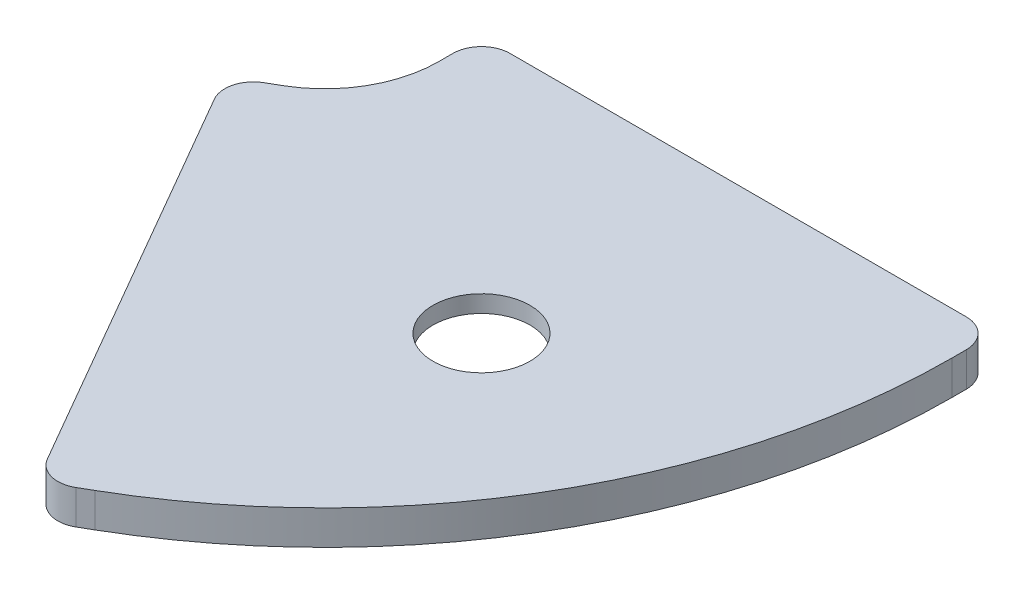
ISO-10303-21;
HEADER;
FILE_DESCRIPTION(('STEP AP214'),'2;1');
FILE_NAME('part.step','',(''),(''),'','','');
FILE_SCHEMA(('AUTOMOTIVE_DESIGN { 1 0 10303 214 1 1 1 1 }'));
ENDSEC;
DATA;
#1=APPLICATION_CONTEXT('core data for automotive mechanical design processes');
#2=APPLICATION_PROTOCOL_DEFINITION('international standard','automotive_design',2000,#1);
#3=PRODUCT_CONTEXT('',#1,'mechanical');
#4=PRODUCT('Part','Part','',(#3));
#5=PRODUCT_RELATED_PRODUCT_CATEGORY('part','',(#4));
#6=PRODUCT_DEFINITION_FORMATION('','',#4);
#7=PRODUCT_DEFINITION_CONTEXT('part definition',#1,'design');
#8=PRODUCT_DEFINITION('design','',#6,#7);
#9=PRODUCT_DEFINITION_SHAPE('','',#8);
#10=(LENGTH_UNIT() NAMED_UNIT(*) SI_UNIT(.MILLI.,.METRE.));
#11=(NAMED_UNIT(*) PLANE_ANGLE_UNIT() SI_UNIT($,.RADIAN.));
#12=(NAMED_UNIT(*) SI_UNIT($,.STERADIAN.) SOLID_ANGLE_UNIT());
#13=UNCERTAINTY_MEASURE_WITH_UNIT(LENGTH_MEASURE(1.E-05),#10,'distance_accuracy_value','');
#14=(GEOMETRIC_REPRESENTATION_CONTEXT(3) GLOBAL_UNCERTAINTY_ASSIGNED_CONTEXT((#13)) GLOBAL_UNIT_ASSIGNED_CONTEXT((#10,
#11,#12)) REPRESENTATION_CONTEXT('',''));
#15=CARTESIAN_POINT('',(0.,0.,0.));
#16=DIRECTION('',(0.,0.,1.));
#17=DIRECTION('',(1.,0.,0.));
#18=AXIS2_PLACEMENT_3D('',#15,#16,#17);
#19=CARTESIAN_POINT('',(22.5,-2.25,22.5));
#20=DIRECTION('',(0.,-1.,0.));
#21=DIRECTION('',(0.,0.,-1.));
#22=AXIS2_PLACEMENT_3D('',#19,#20,#21);
#23=CYLINDRICAL_SURFACE('',#22,6.5);
#24=CARTESIAN_POINT('',(22.5,-1.5,22.5));
#25=DIRECTION('',(0.,1.,0.));
#26=DIRECTION('',(1.,0.,0.));
#27=AXIS2_PLACEMENT_3D('',#24,#25,#26);
#28=CIRCLE('',#27,6.5);
#29=CARTESIAN_POINT('',(29.,-1.5,22.5));
#30=VERTEX_POINT('',#29);
#31=EDGE_CURVE('E9',#30,#30,#28,.T.);
#32=ORIENTED_EDGE('',*,*,#31,.T.);
#33=EDGE_LOOP('',(#32));
#34=FACE_BOUND('',#33,.T.);
#35=CARTESIAN_POINT('',(22.5,-3.,22.5));
#36=DIRECTION('',(0.,1.,0.));
#37=DIRECTION('',(1.,0.,0.));
#38=AXIS2_PLACEMENT_3D('',#35,#36,#37);
#39=CIRCLE('',#38,6.5);
#40=CARTESIAN_POINT('',(29.,-3.,22.5));
#41=VERTEX_POINT('',#40);
#42=EDGE_CURVE('E187',#41,#41,#39,.T.);
#43=ORIENTED_EDGE('',*,*,#42,.F.);
#44=EDGE_LOOP('',(#43));
#45=FACE_BOUND('',#44,.T.);
#46=ADVANCED_FACE('F15',(#34,#45),#23,.F.);
#47=CARTESIAN_POINT('',(22.5,-1.5,22.5));
#48=DIRECTION('',(0.,1.,0.));
#49=DIRECTION('',(0.,0.,1.));
#50=AXIS2_PLACEMENT_3D('',#47,#48,#49);
#51=PLANE('',#50);
#52=CARTESIAN_POINT('',(22.5,-1.5,22.5));
#53=DIRECTION('',(0.,-1.,0.));
#54=DIRECTION('',(0.,0.,-1.));
#55=AXIS2_PLACEMENT_3D('',#52,#53,#54);
#56=CIRCLE('',#55,4.25);
#57=CARTESIAN_POINT('',(22.5,-1.5,18.25));
#58=VERTEX_POINT('',#57);
#59=EDGE_CURVE('E25',#58,#58,#56,.T.);
#60=ORIENTED_EDGE('',*,*,#59,.F.);
#61=EDGE_LOOP('',(#60));
#62=FACE_BOUND('',#61,.T.);
#63=ORIENTED_EDGE('',*,*,#31,.F.);
#64=EDGE_LOOP('',(#63));
#65=FACE_BOUND('',#64,.T.);
#66=ADVANCED_FACE('F214',(#62,#65),#51,.F.);
#67=CARTESIAN_POINT('',(22.5,-1.5,22.5));
#68=DIRECTION('',(0.,-1.,0.));
#69=DIRECTION('',(0.,0.,-1.));
#70=AXIS2_PLACEMENT_3D('',#67,#68,#69);
#71=CYLINDRICAL_SURFACE('',#70,4.25);
#72=ORIENTED_EDGE('',*,*,#59,.T.);
#73=EDGE_LOOP('',(#72));
#74=FACE_BOUND('',#73,.T.);
#75=CARTESIAN_POINT('',(22.5,0.,22.5));
#76=DIRECTION('',(0.,-1.,0.));
#77=DIRECTION('',(0.,0.,-1.));
#78=AXIS2_PLACEMENT_3D('',#75,#76,#77);
#79=CIRCLE('',#78,4.25);
#80=CARTESIAN_POINT('',(22.5,0.,18.25));
#81=VERTEX_POINT('',#80);
#82=EDGE_CURVE('E111',#81,#81,#79,.T.);
#83=ORIENTED_EDGE('',*,*,#82,.F.);
#84=EDGE_LOOP('',(#83));
#85=FACE_BOUND('',#84,.T.);
#86=ADVANCED_FACE('F221',(#74,#85),#71,.F.);
#87=CARTESIAN_POINT('',(2.49999924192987,0.,2.49999972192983));
#88=DIRECTION('',(0.,-1.,0.));
#89=DIRECTION('',(0.,0.,-1.));
#90=AXIS2_PLACEMENT_3D('',#87,#88,#89);
#91=CYLINDRICAL_SURFACE('',#90,2.49999924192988);
#92=CARTESIAN_POINT('',(2.49999924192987,-3.,2.49999972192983));
#93=DIRECTION('',(0.,1.,0.));
#94=DIRECTION('',(1.,0.,0.));
#95=AXIS2_PLACEMENT_3D('',#92,#93,#94);
#96=CIRCLE('',#95,2.49999924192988);
#97=CARTESIAN_POINT('',(2.49999975,-3.,4.4E-07));
#98=VERTEX_POINT('',#97);
#99=CARTESIAN_POINT('',(0.,-3.,2.50000004));
#100=VERTEX_POINT('',#99);
#101=EDGE_CURVE('E200',#98,#100,#96,.T.);
#102=ORIENTED_EDGE('',*,*,#101,.T.);
#103=DIRECTION('',(0.,-1.,0.));
#104=VECTOR('',#103,1.);
#105=CARTESIAN_POINT('',(0.,0.,2.50000004));
#106=LINE('',#105,#104);
#107=CARTESIAN_POINT('',(0.,0.,2.50000004));
#108=VERTEX_POINT('',#107);
#109=EDGE_CURVE('E34',#108,#100,#106,.T.);
#110=ORIENTED_EDGE('',*,*,#109,.F.);
#111=CARTESIAN_POINT('',(2.49999924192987,0.,2.49999972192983));
#112=DIRECTION('',(0.,-1.,0.));
#113=DIRECTION('',(0.,0.,-1.));
#114=AXIS2_PLACEMENT_3D('',#111,#112,#113);
#115=CIRCLE('',#114,2.49999924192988);
#116=CARTESIAN_POINT('',(2.49999975,0.,4.4E-07));
#117=VERTEX_POINT('',#116);
#118=EDGE_CURVE('E198',#108,#117,#115,.T.);
#119=ORIENTED_EDGE('',*,*,#118,.T.);
#120=DIRECTION('',(0.,-1.,0.));
#121=VECTOR('',#120,1.);
#122=CARTESIAN_POINT('',(2.49999975,0.,4.4E-07));
#123=LINE('',#122,#121);
#124=EDGE_CURVE('E125',#117,#98,#123,.T.);
#125=ORIENTED_EDGE('',*,*,#124,.T.);
#126=EDGE_LOOP('',(#102,#110,#119,#125));
#127=FACE_BOUND('',#126,.T.);
#128=ADVANCED_FACE('F229',(#127),#91,.T.);
#129=CARTESIAN_POINT('',(0.,0.,2.50000004));
#130=DIRECTION('',(-0.999999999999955,0.,2.99324566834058E-07));
#131=DIRECTION('',(2.99324566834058E-07,0.,0.999999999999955));
#132=AXIS2_PLACEMENT_3D('',#129,#130,#131);
#133=PLANE('',#132);
#134=DIRECTION('',(2.99324566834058E-07,0.,0.999999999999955));
#135=VECTOR('',#134,1.);
#136=CARTESIAN_POINT('',(3.700000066E-07,-3.,3.73611642));
#137=LINE('',#136,#135);
#138=CARTESIAN_POINT('',(3.70000002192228E-07,-3.,3.73611642));
#139=VERTEX_POINT('',#138);
#140=EDGE_CURVE('E194',#100,#139,#137,.T.);
#141=ORIENTED_EDGE('',*,*,#140,.T.);
#142=DIRECTION('',(0.,-1.,0.));
#143=VECTOR('',#142,1.);
#144=CARTESIAN_POINT('',(3.70000002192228E-07,0.,3.73611642));
#145=LINE('',#144,#143);
#146=CARTESIAN_POINT('',(3.70000002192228E-07,0.,3.73611642));
#147=VERTEX_POINT('',#146);
#148=EDGE_CURVE('E184',#147,#139,#145,.T.);
#149=ORIENTED_EDGE('',*,*,#148,.F.);
#150=DIRECTION('',(-2.99324566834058E-07,0.,-0.999999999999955));
#151=VECTOR('',#150,1.);
#152=CARTESIAN_POINT('',(3.700000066E-07,0.,3.73611642));
#153=LINE('',#152,#151);
#154=EDGE_CURVE('E192',#147,#108,#153,.T.);
#155=ORIENTED_EDGE('',*,*,#154,.T.);
#156=ORIENTED_EDGE('',*,*,#109,.T.);
#157=EDGE_LOOP('',(#141,#149,#155,#156));
#158=FACE_BOUND('',#157,.T.);
#159=ADVANCED_FACE('F233',(#158),#133,.T.);
#160=CARTESIAN_POINT('',(-10.0000027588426,0.,3.73611365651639));
#161=DIRECTION('',(0.,-1.,0.));
#162=DIRECTION('',(0.,0.,-1.));
#163=AXIS2_PLACEMENT_3D('',#160,#161,#162);
#164=CYLINDRICAL_SURFACE('',#163,10.000003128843);
#165=CARTESIAN_POINT('',(-10.0000027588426,-3.,3.73611365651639));
#166=DIRECTION('',(0.,-1.,0.));
#167=DIRECTION('',(0.,0.,-1.));
#168=AXIS2_PLACEMENT_3D('',#165,#166,#167);
#169=CIRCLE('',#168,10.000003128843);
#170=CARTESIAN_POINT('',(-5.00000045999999,-3.,12.39636998));
#171=VERTEX_POINT('',#170);
#172=EDGE_CURVE('E189',#139,#171,#169,.T.);
#173=ORIENTED_EDGE('',*,*,#172,.T.);
#174=DIRECTION('',(0.,-1.,0.));
#175=VECTOR('',#174,1.);
#176=CARTESIAN_POINT('',(-5.00000045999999,0.,12.39636998));
#177=LINE('',#176,#175);
#178=CARTESIAN_POINT('',(-5.00000045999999,0.,12.39636998));
#179=VERTEX_POINT('',#178);
#180=EDGE_CURVE('E176',#179,#171,#177,.T.);
#181=ORIENTED_EDGE('',*,*,#180,.F.);
#182=CARTESIAN_POINT('',(-10.0000027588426,0.,3.73611365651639));
#183=DIRECTION('',(0.,-1.,0.));
#184=DIRECTION('',(0.,0.,-1.));
#185=AXIS2_PLACEMENT_3D('',#182,#183,#184);
#186=CIRCLE('',#185,10.000003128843);
#187=EDGE_CURVE('E185',#147,#179,#186,.T.);
#188=ORIENTED_EDGE('',*,*,#187,.F.);
#189=ORIENTED_EDGE('',*,*,#148,.T.);
#190=EDGE_LOOP('',(#173,#181,#188,#189));
#191=FACE_BOUND('',#190,.T.);
#192=ADVANCED_FACE('F235',(#191),#164,.F.);
#193=CARTESIAN_POINT('',(-5.00000045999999,0.,12.39636998));
#194=DIRECTION('',(-0.50000002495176,0.,-0.866025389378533));
#195=DIRECTION('',(-0.866025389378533,0.,0.50000002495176));
#196=AXIS2_PLACEMENT_3D('',#193,#194,#195);
#197=PLANE('',#196);
#198=DIRECTION('',(-0.866025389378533,0.,0.500000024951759));
#199=VECTOR('',#198,1.);
#200=CARTESIAN_POINT('',(-6.07050842,-3.,13.01442808));
#201=LINE('',#200,#199);
#202=CARTESIAN_POINT('',(-6.07050842,-3.,13.01442808));
#203=VERTEX_POINT('',#202);
#204=EDGE_CURVE('E180',#171,#203,#201,.T.);
#205=ORIENTED_EDGE('',*,*,#204,.T.);
#206=DIRECTION('',(0.,-1.,0.));
#207=VECTOR('',#206,1.);
#208=CARTESIAN_POINT('',(-6.07050842,0.,13.01442808));
#209=LINE('',#208,#207);
#210=CARTESIAN_POINT('',(-6.07050842,0.,13.01442808));
#211=VERTEX_POINT('',#210);
#212=EDGE_CURVE('E168',#211,#203,#209,.T.);
#213=ORIENTED_EDGE('',*,*,#212,.F.);
#214=DIRECTION('',(0.866025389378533,0.,-0.500000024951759));
#215=VECTOR('',#214,1.);
#216=CARTESIAN_POINT('',(-6.07050842,0.,13.01442808));
#217=LINE('',#216,#215);
#218=EDGE_CURVE('E177',#211,#179,#217,.T.);
#219=ORIENTED_EDGE('',*,*,#218,.T.);
#220=ORIENTED_EDGE('',*,*,#180,.T.);
#221=EDGE_LOOP('',(#205,#213,#219,#220));
#222=FACE_BOUND('',#221,.T.);
#223=ADVANCED_FACE('F238',(#222),#197,.T.);
#224=CARTESIAN_POINT('',(-4.8205072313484,0.,15.1794917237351));
#225=DIRECTION('',(0.,-1.,0.));
#226=DIRECTION('',(0.,0.,-1.));
#227=AXIS2_PLACEMENT_3D('',#224,#225,#226);
#228=CYLINDRICAL_SURFACE('',#227,2.50000071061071);
#229=CARTESIAN_POINT('',(-4.8205072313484,-3.,15.1794917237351));
#230=DIRECTION('',(0.,1.,0.));
#231=DIRECTION('',(1.,0.,0.));
#232=AXIS2_PLACEMENT_3D('',#229,#230,#231);
#233=CIRCLE('',#232,2.50000071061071);
#234=CARTESIAN_POINT('',(-6.9855715,-3.,16.42949183));
#235=VERTEX_POINT('',#234);
#236=EDGE_CURVE('E172',#203,#235,#233,.T.);
#237=ORIENTED_EDGE('',*,*,#236,.T.);
#238=DIRECTION('',(0.,-1.,0.));
#239=VECTOR('',#238,1.);
#240=CARTESIAN_POINT('',(-6.9855715,0.,16.42949183));
#241=LINE('',#240,#239);
#242=CARTESIAN_POINT('',(-6.9855715,0.,16.42949183));
#243=VERTEX_POINT('',#242);
#244=EDGE_CURVE('E160',#243,#235,#241,.T.);
#245=ORIENTED_EDGE('',*,*,#244,.F.);
#246=CARTESIAN_POINT('',(-4.8205072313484,0.,15.1794917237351));
#247=DIRECTION('',(0.,-1.,0.));
#248=DIRECTION('',(0.,0.,-1.));
#249=AXIS2_PLACEMENT_3D('',#246,#247,#248);
#250=CIRCLE('',#249,2.50000071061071);
#251=EDGE_CURVE('E169',#243,#211,#250,.T.);
#252=ORIENTED_EDGE('',*,*,#251,.T.);
#253=ORIENTED_EDGE('',*,*,#212,.T.);
#254=EDGE_LOOP('',(#237,#245,#252,#253));
#255=FACE_BOUND('',#254,.T.);
#256=ADVANCED_FACE('F240',(#255),#228,.T.);
#257=CARTESIAN_POINT('',(-6.9855715,0.,16.42949183));
#258=DIRECTION('',(-0.86602541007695,0.,0.499999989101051));
#259=DIRECTION('',(0.499999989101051,0.,0.86602541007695));
#260=AXIS2_PLACEMENT_3D('',#257,#258,#259);
#261=PLANE('',#260);
#262=DIRECTION('',(0.499999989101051,0.,0.86602541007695));
#263=VECTOR('',#262,1.);
#264=CARTESIAN_POINT('',(13.01442812,-3.,51.07050833));
#265=LINE('',#264,#263);
#266=CARTESIAN_POINT('',(13.01442812,-3.,51.07050833));
#267=VERTEX_POINT('',#266);
#268=EDGE_CURVE('E164',#235,#267,#265,.T.);
#269=ORIENTED_EDGE('',*,*,#268,.T.);
#270=DIRECTION('',(0.,-1.,0.));
#271=VECTOR('',#270,1.);
#272=CARTESIAN_POINT('',(13.01442812,0.,51.07050833));
#273=LINE('',#272,#271);
#274=CARTESIAN_POINT('',(13.01442812,0.,51.07050833));
#275=VERTEX_POINT('',#274);
#276=EDGE_CURVE('E152',#275,#267,#273,.T.);
#277=ORIENTED_EDGE('',*,*,#276,.F.);
#278=DIRECTION('',(-0.499999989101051,0.,-0.86602541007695));
#279=VECTOR('',#278,1.);
#280=CARTESIAN_POINT('',(13.01442812,0.,51.07050833));
#281=LINE('',#280,#279);
#282=EDGE_CURVE('E161',#275,#243,#281,.T.);
#283=ORIENTED_EDGE('',*,*,#282,.T.);
#284=ORIENTED_EDGE('',*,*,#244,.T.);
#285=EDGE_LOOP('',(#269,#277,#283,#284));
#286=FACE_BOUND('',#285,.T.);
#287=ADVANCED_FACE('F243',(#286),#261,.T.);
#288=CARTESIAN_POINT('',(15.1794917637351,0.,49.8205071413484));
#289=DIRECTION('',(0.,-1.,0.));
#290=DIRECTION('',(0.,0.,-1.));
#291=AXIS2_PLACEMENT_3D('',#288,#289,#290);
#292=CYLINDRICAL_SURFACE('',#291,2.5000007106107);
#293=CARTESIAN_POINT('',(15.1794917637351,-3.,49.8205071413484));
#294=DIRECTION('',(0.,1.,0.));
#295=DIRECTION('',(1.,0.,0.));
#296=AXIS2_PLACEMENT_3D('',#293,#294,#295);
#297=CIRCLE('',#296,2.5000007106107);
#298=CARTESIAN_POINT('',(16.42949187,-3.,51.98557141));
#299=VERTEX_POINT('',#298);
#300=EDGE_CURVE('E156',#267,#299,#297,.T.);
#301=ORIENTED_EDGE('',*,*,#300,.T.);
#302=DIRECTION('',(0.,-1.,0.));
#303=VECTOR('',#302,1.);
#304=CARTESIAN_POINT('',(16.42949187,0.,51.98557141));
#305=LINE('',#304,#303);
#306=CARTESIAN_POINT('',(16.42949187,0.,51.98557141));
#307=VERTEX_POINT('',#306);
#308=EDGE_CURVE('E144',#307,#299,#305,.T.);
#309=ORIENTED_EDGE('',*,*,#308,.F.);
#310=CARTESIAN_POINT('',(15.1794917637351,0.,49.8205071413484));
#311=DIRECTION('',(0.,-1.,0.));
#312=DIRECTION('',(0.,0.,-1.));
#313=AXIS2_PLACEMENT_3D('',#310,#311,#312);
#314=CIRCLE('',#313,2.5000007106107);
#315=EDGE_CURVE('E153',#307,#275,#314,.T.);
#316=ORIENTED_EDGE('',*,*,#315,.T.);
#317=ORIENTED_EDGE('',*,*,#276,.T.);
#318=EDGE_LOOP('',(#301,#309,#316,#317));
#319=FACE_BOUND('',#318,.T.);
#320=ADVANCED_FACE('F245',(#319),#292,.T.);
#321=CARTESIAN_POINT('',(16.42949187,0.,51.98557141));
#322=DIRECTION('',(0.499999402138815,0.,0.86602574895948));
#323=DIRECTION('',(0.86602574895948,0.,-0.499999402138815));
#324=AXIS2_PLACEMENT_3D('',#321,#322,#323);
#325=PLANE('',#324);
#326=DIRECTION('',(0.866025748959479,0.,-0.499999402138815));
#327=VECTOR('',#326,1.);
#328=CARTESIAN_POINT('',(17.49999972,-3.,51.3675144));
#329=LINE('',#328,#327);
#330=CARTESIAN_POINT('',(17.49999972,-3.,51.3675144));
#331=VERTEX_POINT('',#330);
#332=EDGE_CURVE('E148',#299,#331,#329,.T.);
#333=ORIENTED_EDGE('',*,*,#332,.T.);
#334=DIRECTION('',(0.,-1.,0.));
#335=VECTOR('',#334,1.);
#336=CARTESIAN_POINT('',(17.49999972,0.,51.3675144));
#337=LINE('',#336,#335);
#338=CARTESIAN_POINT('',(17.49999972,0.,51.3675144));
#339=VERTEX_POINT('',#338);
#340=EDGE_CURVE('E136',#339,#331,#337,.T.);
#341=ORIENTED_EDGE('',*,*,#340,.F.);
#342=DIRECTION('',(-0.866025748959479,0.,0.499999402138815));
#343=VECTOR('',#342,1.);
#344=CARTESIAN_POINT('',(17.49999972,0.,51.3675144));
#345=LINE('',#344,#343);
#346=EDGE_CURVE('E145',#339,#307,#345,.T.);
#347=ORIENTED_EDGE('',*,*,#346,.T.);
#348=ORIENTED_EDGE('',*,*,#308,.T.);
#349=EDGE_LOOP('',(#333,#341,#347,#348));
#350=FACE_BOUND('',#349,.T.);
#351=ADVANCED_FACE('F247',(#350),#325,.T.);
#352=CARTESIAN_POINT('',(-10.0000048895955,0.,3.73611474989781));
#353=DIRECTION('',(0.,-1.,0.));
#354=DIRECTION('',(0.,0.,-1.));
#355=AXIS2_PLACEMENT_3D('',#352,#353,#354);
#356=CYLINDRICAL_SURFACE('',#355,55.0000044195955);
#357=CARTESIAN_POINT('',(-10.0000048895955,-3.,3.73611474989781));
#358=DIRECTION('',(0.,1.,0.));
#359=DIRECTION('',(1.,0.,0.));
#360=AXIS2_PLACEMENT_3D('',#357,#358,#359);
#361=CIRCLE('',#360,55.0000044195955);
#362=CARTESIAN_POINT('',(44.99999953,-3.,3.7361159));
#363=VERTEX_POINT('',#362);
#364=EDGE_CURVE('E140',#331,#363,#361,.T.);
#365=ORIENTED_EDGE('',*,*,#364,.T.);
#366=DIRECTION('',(0.,-1.,0.));
#367=VECTOR('',#366,1.);
#368=CARTESIAN_POINT('',(44.99999953,0.,3.7361159));
#369=LINE('',#368,#367);
#370=CARTESIAN_POINT('',(44.99999953,0.,3.7361159));
#371=VERTEX_POINT('',#370);
#372=EDGE_CURVE('E131',#371,#363,#369,.T.);
#373=ORIENTED_EDGE('',*,*,#372,.F.);
#374=CARTESIAN_POINT('',(-10.0000048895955,0.,3.73611474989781));
#375=DIRECTION('',(0.,-1.,0.));
#376=DIRECTION('',(0.,0.,-1.));
#377=AXIS2_PLACEMENT_3D('',#374,#375,#376);
#378=CIRCLE('',#377,55.0000044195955);
#379=EDGE_CURVE('E137',#371,#339,#378,.T.);
#380=ORIENTED_EDGE('',*,*,#379,.T.);
#381=ORIENTED_EDGE('',*,*,#340,.T.);
#382=EDGE_LOOP('',(#365,#373,#380,#381));
#383=FACE_BOUND('',#382,.T.);
#384=ADVANCED_FACE('F249',(#383),#356,.T.);
#385=CARTESIAN_POINT('',(44.99999953,0.,3.7361159));
#386=DIRECTION('',(0.999999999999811,0.,6.14829162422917E-07));
#387=DIRECTION('',(6.14829162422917E-07,0.,-0.999999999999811));
#388=AXIS2_PLACEMENT_3D('',#385,#386,#387);
#389=PLANE('',#388);
#390=DIRECTION('',(6.14829162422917E-07,0.,-0.999999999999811));
#391=VECTOR('',#390,1.);
#392=CARTESIAN_POINT('',(45.00000029,-3.,2.50000017));
#393=LINE('',#392,#391);
#394=CARTESIAN_POINT('',(45.00000029,-3.,2.50000017));
#395=VERTEX_POINT('',#394);
#396=EDGE_CURVE('E132',#363,#395,#393,.T.);
#397=ORIENTED_EDGE('',*,*,#396,.T.);
#398=DIRECTION('',(0.,-1.,0.));
#399=VECTOR('',#398,1.);
#400=CARTESIAN_POINT('',(45.00000029,0.,2.50000017));
#401=LINE('',#400,#399);
#402=CARTESIAN_POINT('',(45.00000029,0.,2.50000017));
#403=VERTEX_POINT('',#402);
#404=EDGE_CURVE('E121',#403,#395,#401,.T.);
#405=ORIENTED_EDGE('',*,*,#404,.F.);
#406=DIRECTION('',(-6.14829162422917E-07,0.,0.999999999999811));
#407=VECTOR('',#406,1.);
#408=CARTESIAN_POINT('',(45.00000029,0.,2.50000017));
#409=LINE('',#408,#407);
#410=EDGE_CURVE('E120',#403,#371,#409,.T.);
#411=ORIENTED_EDGE('',*,*,#410,.T.);
#412=ORIENTED_EDGE('',*,*,#372,.T.);
#413=EDGE_LOOP('',(#397,#405,#411,#412));
#414=FACE_BOUND('',#413,.T.);
#415=ADVANCED_FACE('F251',(#414),#389,.T.);
#416=CARTESIAN_POINT('',(42.4999995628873,0.,2.50000064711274));
#417=DIRECTION('',(0.,-1.,0.));
#418=DIRECTION('',(0.,0.,-1.));
#419=AXIS2_PLACEMENT_3D('',#416,#417,#418);
#420=CYLINDRICAL_SURFACE('',#419,2.50000072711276);
#421=CARTESIAN_POINT('',(42.4999995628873,-3.,2.50000064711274));
#422=DIRECTION('',(0.,1.,0.));
#423=DIRECTION('',(1.,0.,0.));
#424=AXIS2_PLACEMENT_3D('',#421,#422,#423);
#425=CIRCLE('',#424,2.50000072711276);
#426=CARTESIAN_POINT('',(42.49999987,-3.,-8.E-08));
#427=VERTEX_POINT('',#426);
#428=EDGE_CURVE('E109',#395,#427,#425,.T.);
#429=ORIENTED_EDGE('',*,*,#428,.T.);
#430=DIRECTION('',(0.,-1.,0.));
#431=VECTOR('',#430,1.);
#432=CARTESIAN_POINT('',(42.49999987,0.,-8.E-08));
#433=LINE('',#432,#431);
#434=CARTESIAN_POINT('',(42.49999987,0.,-8.E-08));
#435=VERTEX_POINT('',#434);
#436=EDGE_CURVE('E102',#435,#427,#433,.T.);
#437=ORIENTED_EDGE('',*,*,#436,.F.);
#438=CARTESIAN_POINT('',(42.4999995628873,0.,2.50000064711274));
#439=DIRECTION('',(0.,-1.,0.));
#440=DIRECTION('',(0.,0.,-1.));
#441=AXIS2_PLACEMENT_3D('',#438,#439,#440);
#442=CIRCLE('',#441,2.50000072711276);
#443=EDGE_CURVE('E107',#435,#403,#442,.T.);
#444=ORIENTED_EDGE('',*,*,#443,.T.);
#445=ORIENTED_EDGE('',*,*,#404,.T.);
#446=EDGE_LOOP('',(#429,#437,#444,#445));
#447=FACE_BOUND('',#446,.T.);
#448=ADVANCED_FACE('F17',(#447),#420,.T.);
#449=CARTESIAN_POINT('',(42.49999987,0.,-8.E-08));
#450=DIRECTION('',(-1.2999999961E-08,0.,-1.));
#451=DIRECTION('',(-1.,0.,1.2999999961E-08));
#452=AXIS2_PLACEMENT_3D('',#449,#450,#451);
#453=PLANE('',#452);
#454=DIRECTION('',(-1.,0.,1.2999999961E-08));
#455=VECTOR('',#454,1.);
#456=CARTESIAN_POINT('',(2.49999975,-3.,4.4E-07));
#457=LINE('',#456,#455);
#458=EDGE_CURVE('E127',#427,#98,#457,.T.);
#459=ORIENTED_EDGE('',*,*,#458,.T.);
#460=ORIENTED_EDGE('',*,*,#124,.F.);
#461=DIRECTION('',(1.,0.,-1.2999999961E-08));
#462=VECTOR('',#461,1.);
#463=CARTESIAN_POINT('',(2.49999975,0.,4.4E-07));
#464=LINE('',#463,#462);
#465=EDGE_CURVE('E19',#117,#435,#464,.T.);
#466=ORIENTED_EDGE('',*,*,#465,.T.);
#467=ORIENTED_EDGE('',*,*,#436,.T.);
#468=EDGE_LOOP('',(#459,#460,#466,#467));
#469=FACE_BOUND('',#468,.T.);
#470=ADVANCED_FACE('F123',(#469),#453,.T.);
#471=CARTESIAN_POINT('',(19.5449404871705,0.,20.7938957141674));
#472=DIRECTION('',(0.,-1.,0.));
#473=DIRECTION('',(0.,0.,-1.));
#474=AXIS2_PLACEMENT_3D('',#471,#472,#473);
#475=PLANE('',#474);
#476=ORIENTED_EDGE('',*,*,#82,.T.);
#477=EDGE_LOOP('',(#476));
#478=FACE_BOUND('',#477,.T.);
#479=ORIENTED_EDGE('',*,*,#465,.F.);
#480=ORIENTED_EDGE('',*,*,#118,.F.);
#481=ORIENTED_EDGE('',*,*,#154,.F.);
#482=ORIENTED_EDGE('',*,*,#187,.T.);
#483=ORIENTED_EDGE('',*,*,#218,.F.);
#484=ORIENTED_EDGE('',*,*,#251,.F.);
#485=ORIENTED_EDGE('',*,*,#282,.F.);
#486=ORIENTED_EDGE('',*,*,#315,.F.);
#487=ORIENTED_EDGE('',*,*,#346,.F.);
#488=ORIENTED_EDGE('',*,*,#379,.F.);
#489=ORIENTED_EDGE('',*,*,#410,.F.);
#490=ORIENTED_EDGE('',*,*,#443,.F.);
#491=EDGE_LOOP('',(#479,#480,#481,#482,#483,#484,#485,#486,#487,#488,#489,#490));
#492=FACE_BOUND('',#491,.T.);
#493=ADVANCED_FACE('F116',(#478,#492),#475,.F.);
#494=CARTESIAN_POINT('',(19.5449404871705,-3.,20.7938957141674));
#495=DIRECTION('',(0.,-1.,0.));
#496=DIRECTION('',(0.,0.,-1.));
#497=AXIS2_PLACEMENT_3D('',#494,#495,#496);
#498=PLANE('',#497);
#499=ORIENTED_EDGE('',*,*,#42,.T.);
#500=EDGE_LOOP('',(#499));
#501=FACE_BOUND('',#500,.T.);
#502=ORIENTED_EDGE('',*,*,#101,.F.);
#503=ORIENTED_EDGE('',*,*,#458,.F.);
#504=ORIENTED_EDGE('',*,*,#428,.F.);
#505=ORIENTED_EDGE('',*,*,#396,.F.);
#506=ORIENTED_EDGE('',*,*,#364,.F.);
#507=ORIENTED_EDGE('',*,*,#332,.F.);
#508=ORIENTED_EDGE('',*,*,#300,.F.);
#509=ORIENTED_EDGE('',*,*,#268,.F.);
#510=ORIENTED_EDGE('',*,*,#236,.F.);
#511=ORIENTED_EDGE('',*,*,#204,.F.);
#512=ORIENTED_EDGE('',*,*,#172,.F.);
#513=ORIENTED_EDGE('',*,*,#140,.F.);
#514=EDGE_LOOP('',(#502,#503,#504,#505,#506,#507,#508,#509,#510,#511,#512,#513));
#515=FACE_BOUND('',#514,.T.);
#516=ADVANCED_FACE('F210',(#501,#515),#498,.T.);
#517=CLOSED_SHELL('',(#46,#66,#86,#128,#159,#192,#223,#256,#287,#320,#351,#384,#415,#448,#470,
#493,#516));
#518=MANIFOLD_SOLID_BREP('B1',#517);
#519=ADVANCED_BREP_SHAPE_REPRESENTATION('',(#18,#518),#14);
#520=SHAPE_DEFINITION_REPRESENTATION(#9,#519);
ENDSEC;
END-ISO-10303-21;
